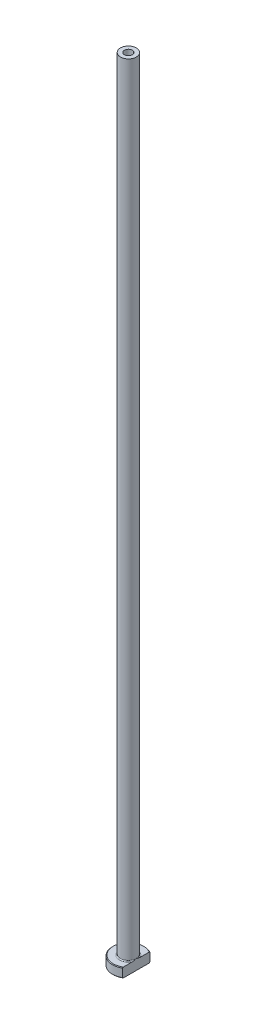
from build123d import *

# Parameters (mm, degrees)
FILLET1_R          = 0.3
CHAMFER1_SIZE      = 0.2
CUT_EXTRUDE1_DEPTH = 251.099980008
CHAMFER2_SIZE      = 0.5


with BuildPart() as part:
    # Sketch1 → Revolve1 (revolve)
    with BuildSketch(Plane.XY, mode=Mode.PRIVATE) as revolve1_sk:
        Polygon((-1.25, 250), (-2.5, 250), (-2.5, 3), (-5, 3), (-5, 0), (-1.5, 0), (-1.5, 203), (-1.25, 215), align=None)
    revolve(revolve1_sk.sketch.rotate(Axis((0, 92.187680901, 0), (0, -1, 0)), 270), axis=Axis((0, 92.187680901, 0), (0, -1, 0)))

    # Fillet1
    fillet1_edges = [part.edges().sort_by_distance(p)[0] for p in [
        (0, 3, -2.5),
    ]]
    fillet(fillet1_edges, radius=FILLET1_R)

    # Chamfer1
    chamfer1_edges = [part.edges().sort_by_distance(p)[0] for p in [
        (0, 0, -5),
        (0, 3, -5),
    ]]
    chamfer(chamfer1_edges, length=CHAMFER1_SIZE)

    # Sketch2 → Cut-Extrude1 (cut, through all)
    with BuildSketch(Plane.XZ):
        with BuildLine():
            Line((2.5, 4.330127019), (2.5, -4.330127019))
            ThreePointArc((2.5, -4.330127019), (5, 0), (2.5, 4.330127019))
        make_face()
    extrude(amount=-CUT_EXTRUDE1_DEPTH, mode=Mode.SUBTRACT)

    # Chamfer2
    chamfer2_edges = [part.edges().sort_by_distance(p)[0] for p in [
        (0, 0, -1.5),
    ]]
    chamfer(chamfer2_edges, length=CHAMFER2_SIZE)


solid = part.part
